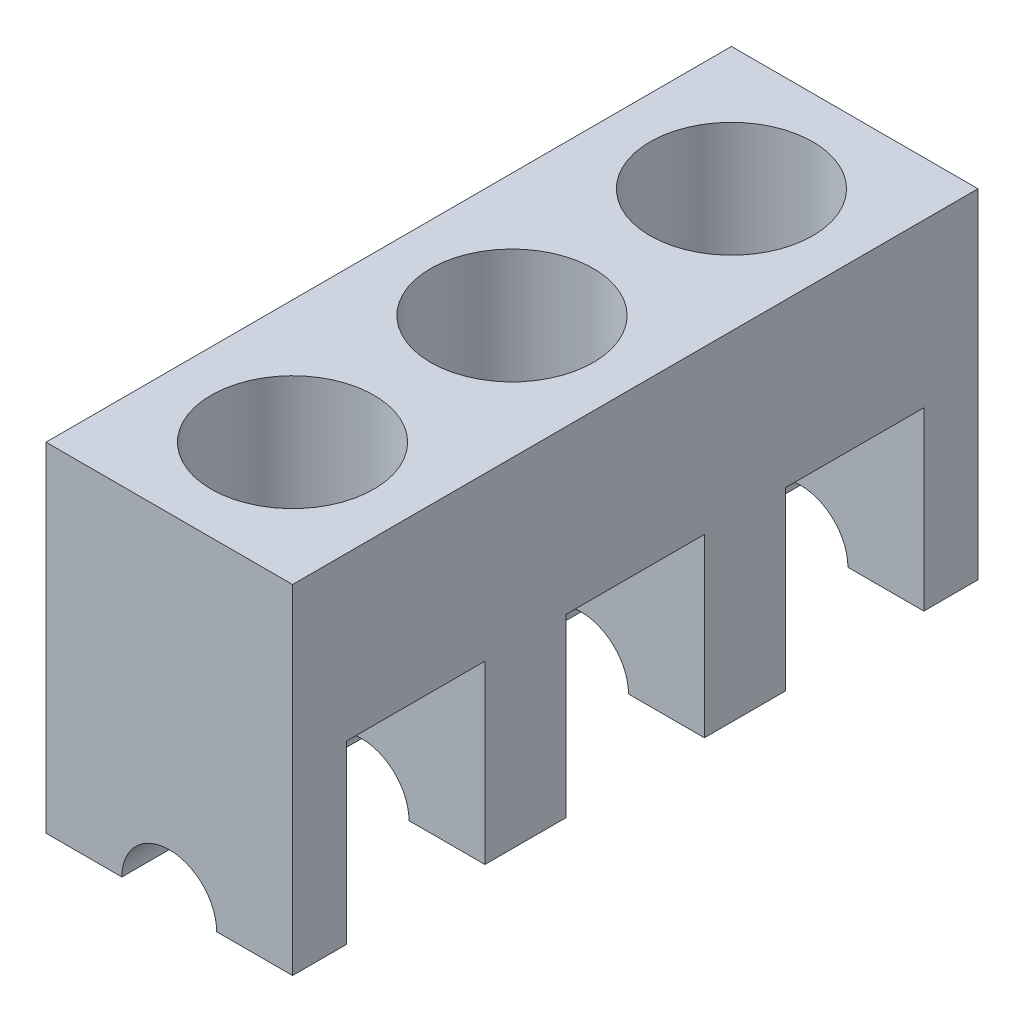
from build123d import *

# Parameters (mm, degrees)
BOSS_EXTRUDE1_DEPTH = 45.5
SKETCH3_R           = 30.05
CUT_EXTRUDE1_DEPTH  = 81
SKETCH4_R           = 17.5
CUT_EXTRUDE2_DEPTH  = 286.839552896


with BuildPart() as part:
    # Sketch2 → Boss-Extrude1 (new, symmetric)
    with BuildSketch(Plane(origin=(0, 0, 0), x_dir=(0, 0, -1), z_dir=(1, 0, 0))):
        Polygon((0, 0), (0, 125), (253, 125), (253, 0), (233, 0), (233, 65), (182, 65), (182, 0), (152, 0), (152, 65), (101, 65), (101, 0), (71, 0), (71, 65), (20, 65), (20, 0), align=None)
    extrude(amount=BOSS_EXTRUDE1_DEPTH, both=True)

    # Sketch3 → Cut-Extrude1 (cut)
    with BuildSketch(Plane(origin=(0, 125, 0), x_dir=(1, 0, 0), z_dir=(0, 1, 0))):
        with Locations(Location((0, 207.5, 0), (0, 0, 270))):
            Circle(SKETCH3_R)
        with Locations(Location((0, 126.5, 0), (0, 0, 270))):
            Circle(SKETCH3_R)
        with Locations(Location((0, 45.5, 0), (0, 0, 270))):
            Circle(SKETCH3_R)
    extrude(amount=-CUT_EXTRUDE1_DEPTH, mode=Mode.SUBTRACT)

    # Sketch4 → Cut-Extrude2 (cut, through all)
    with BuildSketch(Plane.XY):
        Circle(SKETCH4_R)
    extrude(amount=-CUT_EXTRUDE2_DEPTH, mode=Mode.SUBTRACT)


solid = part.part
